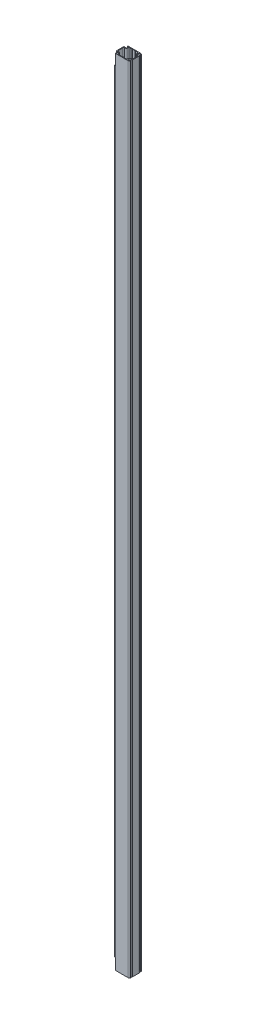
from build123d import *

# Parameters (mm, degrees)
SALIENTE_EXTRUIR1_DEPTH = 5000
CROQUIS2_W              = 14.733998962
CROQUIS2_H              = 10.5
CORTAR_EXTRUIR1_DEPTH   = 70
CROQUIS3_W              = 13.348858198
CROQUIS3_H              = 10.5
CORTAR_EXTRUIR2_DEPTH   = 70


with BuildPart() as part:
    # Croquis1 → Saliente-Extruir1 (new body)
    with BuildSketch(Plane(origin=(0, 0, 0), x_dir=(1, 0, 0), z_dir=(0, 1, 0))):
        with BuildLine():
            Line((39.5, -51.654327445), (-39.5, -51.654327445))
            ThreePointArc((-39.5, -51.654327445), (-45.378848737, -49.854277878), (-49.242036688, -45.071306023))
            ThreePointArc((-49.242036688, -45.071306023), (-48.132501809, -42.469588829), (-45.530784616, -43.579123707))
            ThreePointArc((-45.530784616, -43.579123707), (-33.301534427, -43.111116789), (-43.045454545, -35.706414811))
            ThreePointArc((-43.045454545, -35.706414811), (-47.645290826, -35.890503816), (-50, -31.934782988))
            Line((-50, -31.934782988), (-50, 8.626128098))
            ThreePointArc((-50, 8.626128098), (-47.645290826, 12.581848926), (-43.045454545, 12.397759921))
            ThreePointArc((-43.045454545, 12.397759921), (-33.301534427, 19.8024619), (-45.530784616, 20.270468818))
            ThreePointArc((-45.530784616, 20.270468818), (-48.132501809, 19.16093394), (-49.242036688, 21.762651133))
            ThreePointArc((-49.242036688, 21.762651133), (-45.378848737, 26.545622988), (-39.5, 28.345672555))
            Line((-39.5, 28.345672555), (39.5, 28.345672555))
            ThreePointArc((39.5, 28.345672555), (45.378848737, 26.545622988), (49.242036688, 21.762651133))
            ThreePointArc((49.242036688, 21.762651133), (48.132501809, 19.16093394), (45.530784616, 20.270468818))
            ThreePointArc((45.530784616, 20.270468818), (33.301534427, 19.8024619), (43.045454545, 12.397759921))
            ThreePointArc((43.045454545, 12.397759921), (47.645290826, 12.581848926), (50, 8.626128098))
            Line((50, 8.626128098), (50, -31.934782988))
            ThreePointArc((50, -31.934782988), (47.645290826, -35.890503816), (43.045454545, -35.706414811))
            ThreePointArc((43.045454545, -35.706414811), (33.301534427, -43.111116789), (45.530784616, -43.579123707))
            ThreePointArc((45.530784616, -43.579123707), (48.132501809, -42.469588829), (49.242036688, -45.071306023))
            ThreePointArc((49.242036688, -45.071306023), (45.378848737, -49.854277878), (39.5, -51.654327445))
        make_face()
        with BuildLine():
            Line((22.5, 24.345672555), (12.5, 24.345672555))
            Line((12.5, 24.345672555), (11, 22.845672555))
            Line((11, 22.845672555), (8, 22.845672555))
            Line((8, 22.845672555), (6.5, 24.345672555))
            Line((6.5, 24.345672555), (-6.5, 24.345672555))
            Line((-6.5, 24.345672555), (-8, 22.845672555))
            Line((-8, 22.845672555), (-11, 22.845672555))
            Line((-11, 22.845672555), (-12.5, 24.345672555))
            Line((-12.5, 24.345672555), (-22.5, 24.345672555))
            ThreePointArc((-22.5, 24.345672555), (-27.096194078, 22.441866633), (-29, 17.845672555))
            ThreePointArc((-29, 17.845672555), (-32.075378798, 10.421051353), (-39.5, 7.345672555))
            ThreePointArc((-39.5, 7.345672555), (-44.096194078, 5.441866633), (-46, 0.845672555))
            Line((-46, 0.845672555), (-46, -24.154327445))
            ThreePointArc((-46, -24.154327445), (-44.096194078, -28.750521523), (-39.5, -30.654327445))
            ThreePointArc((-39.5, -30.654327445), (-32.075378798, -33.729706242), (-29, -41.154327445))
            ThreePointArc((-29, -41.154327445), (-27.096194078, -45.750521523), (-22.5, -47.654327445))
            Line((-22.5, -47.654327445), (-12.5, -47.654327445))
            Line((-12.5, -47.654327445), (-11, -46.154327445))
            Line((-11, -46.154327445), (-8, -46.154327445))
            Line((-8, -46.154327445), (-6.5, -47.654327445))
            Line((-6.5, -47.654327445), (6.5, -47.654327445))
            Line((6.5, -47.654327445), (8, -46.154327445))
            Line((8, -46.154327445), (11, -46.154327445))
            Line((11, -46.154327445), (12.5, -47.654327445))
            Line((12.5, -47.654327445), (22.5, -47.654327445))
            ThreePointArc((22.5, -47.654327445), (27.096194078, -45.750521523), (29, -41.154327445))
            ThreePointArc((29, -41.154327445), (32.075378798, -33.729706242), (39.5, -30.654327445))
            ThreePointArc((39.5, -30.654327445), (44.096194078, -28.750521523), (46, -24.154327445))
            Line((46, -24.154327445), (46, 0.845672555))
            ThreePointArc((46, 0.845672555), (44.096194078, 5.441866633), (39.5, 7.345672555))
            ThreePointArc((39.5, 7.345672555), (32.075378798, 10.421051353), (29, 17.845672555))
            ThreePointArc((29, 17.845672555), (27.096194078, 22.441866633), (22.5, 24.345672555))
        make_face(mode=Mode.SUBTRACT)
    extrude(amount=SALIENTE_EXTRUIR1_DEPTH)

    # Croquis2 → Cortar-Extruir1 (cut)
    with BuildSketch(Plane(origin=(0, 5000, 0), x_dir=(1, 0, 0), z_dir=(0, 1, 0))):
        with Locations((-46.866999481, 23.095672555)):
            Rectangle(CROQUIS2_W, CROQUIS2_H)
        with Locations((-46.866999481, -46.404327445)):
            Rectangle(CROQUIS2_W, CROQUIS2_H)
    extrude(amount=-CORTAR_EXTRUIR1_DEPTH, mode=Mode.SUBTRACT)

    # Croquis3 → Cortar-Extruir2 (cut)
    with BuildSketch(Plane.XZ):
        with Locations((-46.174429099, 46.404327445)):
            Rectangle(CROQUIS3_W, CROQUIS3_H)
        with Locations((-46.174429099, -23.095672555)):
            Rectangle(CROQUIS3_W, CROQUIS3_H)
    extrude(amount=-CORTAR_EXTRUIR2_DEPTH, mode=Mode.SUBTRACT)


solid = part.part
